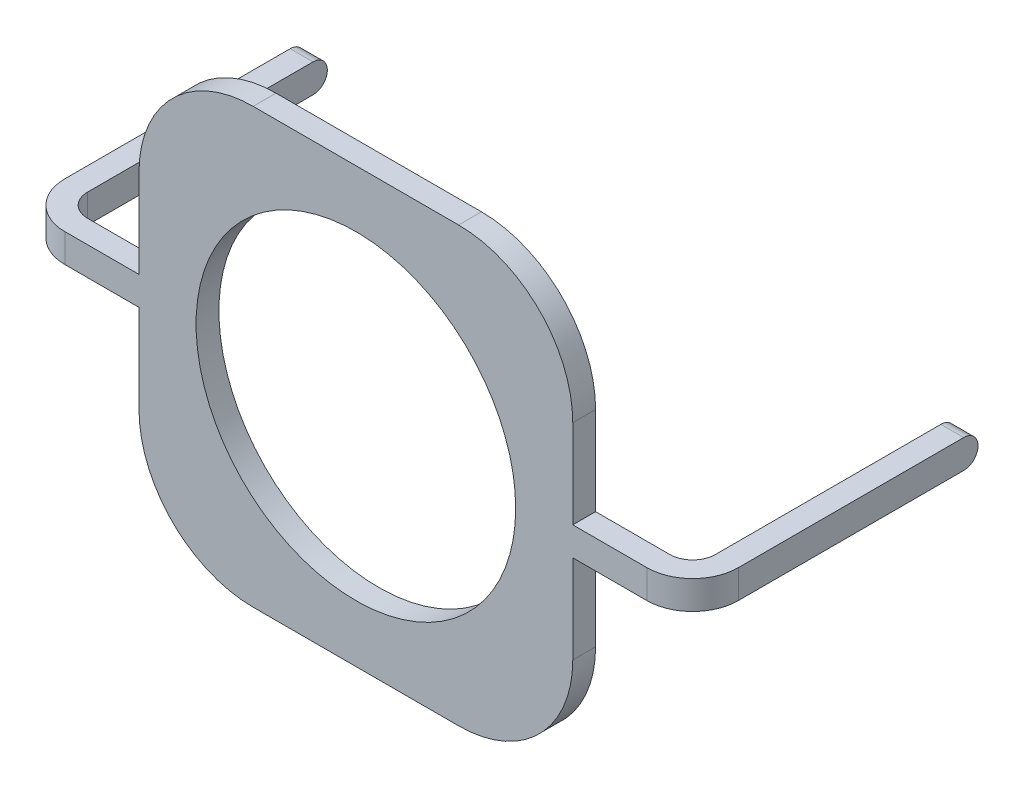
ISO-10303-21;
HEADER;
FILE_DESCRIPTION(('STEP AP214'),'2;1');
FILE_NAME('part.step','',(''),(''),'','','');
FILE_SCHEMA(('AUTOMOTIVE_DESIGN { 1 0 10303 214 1 1 1 1 }'));
ENDSEC;
DATA;
#1=APPLICATION_CONTEXT('core data for automotive mechanical design processes');
#2=APPLICATION_PROTOCOL_DEFINITION('international standard','automotive_design',2000,#1);
#3=PRODUCT_CONTEXT('',#1,'mechanical');
#4=PRODUCT('Part','Part','',(#3));
#5=PRODUCT_RELATED_PRODUCT_CATEGORY('part','',(#4));
#6=PRODUCT_DEFINITION_FORMATION('','',#4);
#7=PRODUCT_DEFINITION_CONTEXT('part definition',#1,'design');
#8=PRODUCT_DEFINITION('design','',#6,#7);
#9=PRODUCT_DEFINITION_SHAPE('','',#8);
#10=(LENGTH_UNIT() NAMED_UNIT(*) SI_UNIT(.MILLI.,.METRE.));
#11=(NAMED_UNIT(*) PLANE_ANGLE_UNIT() SI_UNIT($,.RADIAN.));
#12=(NAMED_UNIT(*) SI_UNIT($,.STERADIAN.) SOLID_ANGLE_UNIT());
#13=UNCERTAINTY_MEASURE_WITH_UNIT(LENGTH_MEASURE(1.E-05),#10,'distance_accuracy_value','');
#14=(GEOMETRIC_REPRESENTATION_CONTEXT(3) GLOBAL_UNCERTAINTY_ASSIGNED_CONTEXT((#13)) GLOBAL_UNIT_ASSIGNED_CONTEXT((#10,
#11,#12)) REPRESENTATION_CONTEXT('',''));
#15=CARTESIAN_POINT('',(0.,0.,0.));
#16=DIRECTION('',(0.,0.,1.));
#17=DIRECTION('',(1.,0.,0.));
#18=AXIS2_PLACEMENT_3D('',#15,#16,#17);
#19=CARTESIAN_POINT('',(-10.,10.,2.));
#20=DIRECTION('',(0.,0.,-1.));
#21=DIRECTION('',(-1.,0.,0.));
#22=AXIS2_PLACEMENT_3D('',#19,#20,#21);
#23=PLANE('',#22);
#24=DIRECTION('',(-1.,0.,0.));
#25=VECTOR('',#24,1.);
#26=CARTESIAN_POINT('',(-38.,20.25,1.99999999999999));
#27=LINE('',#26,#25);
#28=CARTESIAN_POINT('',(-38.,20.25,1.99999999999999));
#29=VERTEX_POINT('',#28);
#30=CARTESIAN_POINT('',(-44.5,20.25,1.99999999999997));
#31=VERTEX_POINT('',#30);
#32=EDGE_CURVE('E263',#29,#31,#27,.T.);
#33=ORIENTED_EDGE('',*,*,#32,.T.);
#34=DIRECTION('',(0.,1.,0.));
#35=VECTOR('',#34,1.);
#36=CARTESIAN_POINT('',(-44.5,10.,1.99999999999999));
#37=LINE('',#36,#35);
#38=CARTESIAN_POINT('',(-44.5,17.75,1.99999999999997));
#39=VERTEX_POINT('',#38);
#40=EDGE_CURVE('E415',#31,#39,#37,.F.);
#41=ORIENTED_EDGE('',*,*,#40,.T.);
#42=DIRECTION('',(1.,0.,0.));
#43=VECTOR('',#42,1.);
#44=CARTESIAN_POINT('',(-38.,17.75,1.99999999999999));
#45=LINE('',#44,#43);
#46=CARTESIAN_POINT('',(-38.,17.75,1.99999999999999));
#47=VERTEX_POINT('',#46);
#48=EDGE_CURVE('E266',#39,#47,#45,.T.);
#49=ORIENTED_EDGE('',*,*,#48,.T.);
#50=DIRECTION('',(0.,-1.,0.));
#51=VECTOR('',#50,1.);
#52=CARTESIAN_POINT('',(-38.,17.75,1.99999999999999));
#53=LINE('',#52,#51);
#54=CARTESIAN_POINT('',(-38.,10.,2.));
#55=VERTEX_POINT('',#54);
#56=EDGE_CURVE('E268',#47,#55,#53,.T.);
#57=ORIENTED_EDGE('',*,*,#56,.T.);
#58=CARTESIAN_POINT('',(-28.,10.,2.));
#59=DIRECTION('',(0.,0.,1.));
#60=DIRECTION('',(1.,0.,0.));
#61=AXIS2_PLACEMENT_3D('',#58,#59,#60);
#62=CIRCLE('',#61,10.);
#63=CARTESIAN_POINT('',(-28.,0.,2.));
#64=VERTEX_POINT('',#63);
#65=EDGE_CURVE('E270',#55,#64,#62,.T.);
#66=ORIENTED_EDGE('',*,*,#65,.T.);
#67=DIRECTION('',(1.,0.,0.));
#68=VECTOR('',#67,1.);
#69=CARTESIAN_POINT('',(-28.,0.,2.));
#70=LINE('',#69,#68);
#71=CARTESIAN_POINT('',(-10.,0.,2.));
#72=VERTEX_POINT('',#71);
#73=EDGE_CURVE('E272',#64,#72,#70,.T.);
#74=ORIENTED_EDGE('',*,*,#73,.T.);
#75=CARTESIAN_POINT('',(-10.,10.,2.));
#76=DIRECTION('',(0.,0.,1.));
#77=DIRECTION('',(-1.,0.,0.));
#78=AXIS2_PLACEMENT_3D('',#75,#76,#77);
#79=CIRCLE('',#78,10.);
#80=CARTESIAN_POINT('',(0.,10.0000000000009,2.));
#81=VERTEX_POINT('',#80);
#82=EDGE_CURVE('E245',#72,#81,#79,.T.);
#83=ORIENTED_EDGE('',*,*,#82,.T.);
#84=DIRECTION('',(0.,1.,0.));
#85=VECTOR('',#84,1.);
#86=CARTESIAN_POINT('',(0.,17.7500000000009,1.99999999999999));
#87=LINE('',#86,#85);
#88=CARTESIAN_POINT('',(0.,17.7500000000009,1.99999999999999));
#89=VERTEX_POINT('',#88);
#90=EDGE_CURVE('E209',#81,#89,#87,.T.);
#91=ORIENTED_EDGE('',*,*,#90,.T.);
#92=DIRECTION('',(1.,0.,0.));
#93=VECTOR('',#92,1.);
#94=CARTESIAN_POINT('',(0.,17.7500000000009,1.99999999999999));
#95=LINE('',#94,#93);
#96=CARTESIAN_POINT('',(6.50000000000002,17.7500000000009,2.));
#97=VERTEX_POINT('',#96);
#98=EDGE_CURVE('E248',#89,#97,#95,.T.);
#99=ORIENTED_EDGE('',*,*,#98,.T.);
#100=DIRECTION('',(0.,-1.,0.));
#101=VECTOR('',#100,1.);
#102=CARTESIAN_POINT('',(6.50000000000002,10.0000000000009,2.));
#103=LINE('',#102,#101);
#104=CARTESIAN_POINT('',(6.5,20.2500000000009,1.99999999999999));
#105=VERTEX_POINT('',#104);
#106=EDGE_CURVE('E420',#97,#105,#103,.F.);
#107=ORIENTED_EDGE('',*,*,#106,.T.);
#108=DIRECTION('',(-1.,0.,0.));
#109=VECTOR('',#108,1.);
#110=CARTESIAN_POINT('',(0.,20.2500000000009,1.99999999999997));
#111=LINE('',#110,#109);
#112=CARTESIAN_POINT('',(0.,20.2500000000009,1.99999999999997));
#113=VERTEX_POINT('',#112);
#114=EDGE_CURVE('E251',#105,#113,#111,.T.);
#115=ORIENTED_EDGE('',*,*,#114,.T.);
#116=DIRECTION('',(0.,1.,0.));
#117=VECTOR('',#116,1.);
#118=CARTESIAN_POINT('',(0.,28.0000000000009,2.));
#119=LINE('',#118,#117);
#120=CARTESIAN_POINT('',(0.,28.0000000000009,2.));
#121=VERTEX_POINT('',#120);
#122=EDGE_CURVE('E253',#113,#121,#119,.T.);
#123=ORIENTED_EDGE('',*,*,#122,.T.);
#124=CARTESIAN_POINT('',(-10.,28.0000000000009,2.));
#125=DIRECTION('',(0.,0.,1.));
#126=DIRECTION('',(1.,0.,0.));
#127=AXIS2_PLACEMENT_3D('',#124,#125,#126);
#128=CIRCLE('',#127,10.);
#129=CARTESIAN_POINT('',(-10.,38.000000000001,2.));
#130=VERTEX_POINT('',#129);
#131=EDGE_CURVE('E255',#121,#130,#128,.T.);
#132=ORIENTED_EDGE('',*,*,#131,.T.);
#133=DIRECTION('',(-1.,0.,0.));
#134=VECTOR('',#133,1.);
#135=CARTESIAN_POINT('',(-28.,38.000000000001,2.));
#136=LINE('',#135,#134);
#137=CARTESIAN_POINT('',(-28.,38.000000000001,2.));
#138=VERTEX_POINT('',#137);
#139=EDGE_CURVE('E257',#130,#138,#136,.T.);
#140=ORIENTED_EDGE('',*,*,#139,.T.);
#141=CARTESIAN_POINT('',(-28.,28.0000000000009,2.));
#142=DIRECTION('',(0.,0.,1.));
#143=DIRECTION('',(1.,0.,0.));
#144=AXIS2_PLACEMENT_3D('',#141,#142,#143);
#145=CIRCLE('',#144,10.);
#146=CARTESIAN_POINT('',(-38.,28.,2.));
#147=VERTEX_POINT('',#146);
#148=EDGE_CURVE('E259',#138,#147,#145,.T.);
#149=ORIENTED_EDGE('',*,*,#148,.T.);
#150=DIRECTION('',(0.,-1.,0.));
#151=VECTOR('',#150,1.);
#152=CARTESIAN_POINT('',(-38.,28.,2.));
#153=LINE('',#152,#151);
#154=EDGE_CURVE('E261',#147,#29,#153,.T.);
#155=ORIENTED_EDGE('',*,*,#154,.T.);
#156=EDGE_LOOP('',(#33,#41,#49,#57,#66,#74,#83,#91,#99,#107,#115,#123,#132,#140,#149,#155));
#157=FACE_BOUND('',#156,.T.);
#158=CARTESIAN_POINT('',(-19.,19.,1.99999999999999));
#159=DIRECTION('',(0.,0.,1.));
#160=DIRECTION('',(1.,0.,0.));
#161=AXIS2_PLACEMENT_3D('',#158,#159,#160);
#162=CIRCLE('',#161,14.);
#163=CARTESIAN_POINT('',(-5.,19.,1.99999999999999));
#164=VERTEX_POINT('',#163);
#165=EDGE_CURVE('E219',#164,#164,#162,.T.);
#166=ORIENTED_EDGE('',*,*,#165,.F.);
#167=EDGE_LOOP('',(#166));
#168=FACE_BOUND('',#167,.T.);
#169=ADVANCED_FACE('F22',(#157,#168),#23,.F.);
#170=CARTESIAN_POINT('',(-10.,10.0000000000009,0.));
#171=DIRECTION('',(0.,0.,-1.));
#172=DIRECTION('',(-1.,0.,0.));
#173=AXIS2_PLACEMENT_3D('',#170,#171,#172);
#174=PLANE('',#173);
#175=DIRECTION('',(1.,0.,0.));
#176=VECTOR('',#175,1.);
#177=CARTESIAN_POINT('',(-38.,17.75,0.));
#178=LINE('',#177,#176);
#179=CARTESIAN_POINT('',(-44.5,17.75,0.));
#180=VERTEX_POINT('',#179);
#181=CARTESIAN_POINT('',(-38.,17.75,0.));
#182=VERTEX_POINT('',#181);
#183=EDGE_CURVE('E241',#180,#182,#178,.T.);
#184=ORIENTED_EDGE('',*,*,#183,.F.);
#185=DIRECTION('',(0.,-1.,0.));
#186=VECTOR('',#185,1.);
#187=CARTESIAN_POINT('',(-44.4999999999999,20.25,0.));
#188=LINE('',#187,#186);
#189=CARTESIAN_POINT('',(-44.4999999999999,20.25,0.));
#190=VERTEX_POINT('',#189);
#191=EDGE_CURVE('E313',#180,#190,#188,.F.);
#192=ORIENTED_EDGE('',*,*,#191,.T.);
#193=DIRECTION('',(-1.,0.,0.));
#194=VECTOR('',#193,1.);
#195=CARTESIAN_POINT('',(-37.9999999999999,20.25,0.));
#196=LINE('',#195,#194);
#197=CARTESIAN_POINT('',(-37.9999999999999,20.25,0.));
#198=VERTEX_POINT('',#197);
#199=EDGE_CURVE('E237',#198,#190,#196,.T.);
#200=ORIENTED_EDGE('',*,*,#199,.F.);
#201=DIRECTION('',(0.,-1.,0.));
#202=VECTOR('',#201,1.);
#203=CARTESIAN_POINT('',(-38.,28.,0.));
#204=LINE('',#203,#202);
#205=CARTESIAN_POINT('',(-38.,28.,0.));
#206=VERTEX_POINT('',#205);
#207=EDGE_CURVE('E235',#206,#198,#204,.T.);
#208=ORIENTED_EDGE('',*,*,#207,.F.);
#209=CARTESIAN_POINT('',(-28.0000000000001,28.0000000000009,0.));
#210=DIRECTION('',(0.,0.,1.));
#211=DIRECTION('',(1.,0.,0.));
#212=AXIS2_PLACEMENT_3D('',#209,#210,#211);
#213=CIRCLE('',#212,10.);
#214=CARTESIAN_POINT('',(-28.,38.000000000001,0.));
#215=VERTEX_POINT('',#214);
#216=EDGE_CURVE('E233',#215,#206,#213,.T.);
#217=ORIENTED_EDGE('',*,*,#216,.F.);
#218=DIRECTION('',(-1.,0.,0.));
#219=VECTOR('',#218,1.);
#220=CARTESIAN_POINT('',(-28.,38.000000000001,0.));
#221=LINE('',#220,#219);
#222=CARTESIAN_POINT('',(-10.,38.000000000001,0.));
#223=VERTEX_POINT('',#222);
#224=EDGE_CURVE('E231',#223,#215,#221,.T.);
#225=ORIENTED_EDGE('',*,*,#224,.F.);
#226=CARTESIAN_POINT('',(-10.,28.0000000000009,0.));
#227=DIRECTION('',(0.,0.,1.));
#228=DIRECTION('',(1.,0.,0.));
#229=AXIS2_PLACEMENT_3D('',#226,#227,#228);
#230=CIRCLE('',#229,10.);
#231=CARTESIAN_POINT('',(0.,28.0000000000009,0.));
#232=VERTEX_POINT('',#231);
#233=EDGE_CURVE('E228',#232,#223,#230,.T.);
#234=ORIENTED_EDGE('',*,*,#233,.F.);
#235=DIRECTION('',(0.,1.,0.));
#236=VECTOR('',#235,1.);
#237=CARTESIAN_POINT('',(0.,28.0000000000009,0.));
#238=LINE('',#237,#236);
#239=CARTESIAN_POINT('',(0.,20.2500000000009,0.));
#240=VERTEX_POINT('',#239);
#241=EDGE_CURVE('E226',#240,#232,#238,.T.);
#242=ORIENTED_EDGE('',*,*,#241,.F.);
#243=DIRECTION('',(-1.,0.,0.));
#244=VECTOR('',#243,1.);
#245=CARTESIAN_POINT('',(0.,20.2500000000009,0.));
#246=LINE('',#245,#244);
#247=CARTESIAN_POINT('',(6.5,20.2500000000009,0.));
#248=VERTEX_POINT('',#247);
#249=EDGE_CURVE('E229',#248,#240,#246,.T.);
#250=ORIENTED_EDGE('',*,*,#249,.F.);
#251=DIRECTION('',(0.,1.,0.));
#252=VECTOR('',#251,1.);
#253=CARTESIAN_POINT('',(6.50000000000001,17.7500000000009,0.));
#254=LINE('',#253,#252);
#255=CARTESIAN_POINT('',(6.50000000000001,17.7500000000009,0.));
#256=VERTEX_POINT('',#255);
#257=EDGE_CURVE('E311',#248,#256,#254,.F.);
#258=ORIENTED_EDGE('',*,*,#257,.T.);
#259=DIRECTION('',(1.,0.,0.));
#260=VECTOR('',#259,1.);
#261=CARTESIAN_POINT('',(0.,17.7500000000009,0.));
#262=LINE('',#261,#260);
#263=CARTESIAN_POINT('',(0.,17.7500000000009,0.));
#264=VERTEX_POINT('',#263);
#265=EDGE_CURVE('E201',#264,#256,#262,.T.);
#266=ORIENTED_EDGE('',*,*,#265,.F.);
#267=DIRECTION('',(0.,1.,0.));
#268=VECTOR('',#267,1.);
#269=CARTESIAN_POINT('',(0.,17.7500000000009,0.));
#270=LINE('',#269,#268);
#271=CARTESIAN_POINT('',(0.,10.0000000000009,0.));
#272=VERTEX_POINT('',#271);
#273=EDGE_CURVE('E192',#272,#264,#270,.T.);
#274=ORIENTED_EDGE('',*,*,#273,.F.);
#275=CARTESIAN_POINT('',(-10.,10.0000000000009,0.));
#276=DIRECTION('',(0.,0.,1.));
#277=DIRECTION('',(-1.,0.,0.));
#278=AXIS2_PLACEMENT_3D('',#275,#276,#277);
#279=CIRCLE('',#278,10.);
#280=CARTESIAN_POINT('',(-10.,0.,0.));
#281=VERTEX_POINT('',#280);
#282=EDGE_CURVE('E199',#281,#272,#279,.T.);
#283=ORIENTED_EDGE('',*,*,#282,.F.);
#284=DIRECTION('',(1.,0.,0.));
#285=VECTOR('',#284,1.);
#286=CARTESIAN_POINT('',(-28.,0.,0.));
#287=LINE('',#286,#285);
#288=CARTESIAN_POINT('',(-28.,0.,0.));
#289=VERTEX_POINT('',#288);
#290=EDGE_CURVE('E243',#289,#281,#287,.T.);
#291=ORIENTED_EDGE('',*,*,#290,.F.);
#292=CARTESIAN_POINT('',(-28.,10.,0.));
#293=DIRECTION('',(0.,0.,1.));
#294=DIRECTION('',(1.,0.,0.));
#295=AXIS2_PLACEMENT_3D('',#292,#293,#294);
#296=CIRCLE('',#295,10.);
#297=CARTESIAN_POINT('',(-38.,10.,0.));
#298=VERTEX_POINT('',#297);
#299=EDGE_CURVE('E240',#298,#289,#296,.T.);
#300=ORIENTED_EDGE('',*,*,#299,.F.);
#301=DIRECTION('',(0.,-1.,0.));
#302=VECTOR('',#301,1.);
#303=CARTESIAN_POINT('',(-38.,17.75,0.));
#304=LINE('',#303,#302);
#305=EDGE_CURVE('E238',#182,#298,#304,.T.);
#306=ORIENTED_EDGE('',*,*,#305,.F.);
#307=EDGE_LOOP('',(#184,#192,#200,#208,#217,#225,#234,#242,#250,#258,#266,#274,#283,#291,#300,#306));
#308=FACE_BOUND('',#307,.T.);
#309=CARTESIAN_POINT('',(-19.,19.0000000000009,0.));
#310=DIRECTION('',(0.,0.,1.));
#311=DIRECTION('',(1.,0.,0.));
#312=AXIS2_PLACEMENT_3D('',#309,#310,#311);
#313=CIRCLE('',#312,14.);
#314=CARTESIAN_POINT('',(-5.,19.0000000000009,0.));
#315=VERTEX_POINT('',#314);
#316=EDGE_CURVE('E222',#315,#315,#313,.T.);
#317=ORIENTED_EDGE('',*,*,#316,.T.);
#318=EDGE_LOOP('',(#317));
#319=FACE_BOUND('',#318,.T.);
#320=ADVANCED_FACE('F195',(#308,#319),#174,.T.);
#321=CARTESIAN_POINT('',(-10.,10.,2.));
#322=DIRECTION('',(0.,0.,-1.));
#323=DIRECTION('',(-1.,0.,0.));
#324=AXIS2_PLACEMENT_3D('',#321,#322,#323);
#325=CYLINDRICAL_SURFACE('',#324,10.);
#326=ORIENTED_EDGE('',*,*,#282,.T.);
#327=DIRECTION('',(0.,0.,-1.));
#328=VECTOR('',#327,1.);
#329=CARTESIAN_POINT('',(0.,10.0000000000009,2.));
#330=LINE('',#329,#328);
#331=EDGE_CURVE('E207',#81,#272,#330,.T.);
#332=ORIENTED_EDGE('',*,*,#331,.F.);
#333=ORIENTED_EDGE('',*,*,#82,.F.);
#334=DIRECTION('',(0.,0.,-1.));
#335=VECTOR('',#334,1.);
#336=CARTESIAN_POINT('',(-10.,0.,2.));
#337=LINE('',#336,#335);
#338=EDGE_CURVE('E218',#72,#281,#337,.T.);
#339=ORIENTED_EDGE('',*,*,#338,.T.);
#340=EDGE_LOOP('',(#326,#332,#333,#339));
#341=FACE_BOUND('',#340,.T.);
#342=ADVANCED_FACE('F24',(#341),#325,.T.);
#343=CARTESIAN_POINT('',(0.,17.7500000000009,1.99999999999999));
#344=DIRECTION('',(-1.,0.,0.));
#345=DIRECTION('',(0.,-1.,0.));
#346=AXIS2_PLACEMENT_3D('',#343,#344,#345);
#347=PLANE('',#346);
#348=ORIENTED_EDGE('',*,*,#273,.T.);
#349=DIRECTION('',(0.,0.,-1.));
#350=VECTOR('',#349,1.);
#351=CARTESIAN_POINT('',(0.,17.7500000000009,1.99999999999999));
#352=LINE('',#351,#350);
#353=EDGE_CURVE('E214',#89,#264,#352,.T.);
#354=ORIENTED_EDGE('',*,*,#353,.F.);
#355=ORIENTED_EDGE('',*,*,#90,.F.);
#356=ORIENTED_EDGE('',*,*,#331,.T.);
#357=EDGE_LOOP('',(#348,#354,#355,#356));
#358=FACE_BOUND('',#357,.T.);
#359=ADVANCED_FACE('F208',(#358),#347,.F.);
#360=CARTESIAN_POINT('',(0.,17.7500000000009,1.99999999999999));
#361=DIRECTION('',(0.,1.,0.));
#362=DIRECTION('',(0.,0.,1.));
#363=AXIS2_PLACEMENT_3D('',#360,#361,#362);
#364=PLANE('',#363);
#365=DIRECTION('',(0.,0.,-1.));
#366=VECTOR('',#365,1.);
#367=CARTESIAN_POINT('',(8.50000000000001,17.7500000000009,1.99999999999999));
#368=LINE('',#367,#366);
#369=CARTESIAN_POINT('',(8.50000000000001,17.7500000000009,-2.00000000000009));
#370=VERTEX_POINT('',#369);
#371=CARTESIAN_POINT('',(8.50000000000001,17.7500000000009,-21.7500000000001));
#372=VERTEX_POINT('',#371);
#373=EDGE_CURVE('E317',#370,#372,#368,.T.);
#374=ORIENTED_EDGE('',*,*,#373,.T.);
#375=DIRECTION('',(-1.,0.,0.));
#376=VECTOR('',#375,1.);
#377=CARTESIAN_POINT('',(0.,17.7500000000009,-21.7500000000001));
#378=LINE('',#377,#376);
#379=CARTESIAN_POINT('',(10.5,17.7500000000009,-21.7500000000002));
#380=VERTEX_POINT('',#379);
#381=EDGE_CURVE('E341',#372,#380,#378,.F.);
#382=ORIENTED_EDGE('',*,*,#381,.T.);
#383=DIRECTION('',(0.,0.,-1.));
#384=VECTOR('',#383,1.);
#385=CARTESIAN_POINT('',(10.5,17.7500000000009,1.99999999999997));
#386=LINE('',#385,#384);
#387=CARTESIAN_POINT('',(10.5,17.7500000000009,-2.00000000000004));
#388=VERTEX_POINT('',#387);
#389=EDGE_CURVE('E330',#388,#380,#386,.T.);
#390=ORIENTED_EDGE('',*,*,#389,.F.);
#391=CARTESIAN_POINT('',(6.50000000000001,17.7500000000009,-2.));
#392=DIRECTION('',(0.,1.,0.));
#393=DIRECTION('',(0.,0.,1.));
#394=AXIS2_PLACEMENT_3D('',#391,#392,#393);
#395=CIRCLE('',#394,4.);
#396=EDGE_CURVE('E430',#388,#97,#395,.F.);
#397=ORIENTED_EDGE('',*,*,#396,.T.);
#398=ORIENTED_EDGE('',*,*,#98,.F.);
#399=ORIENTED_EDGE('',*,*,#353,.T.);
#400=ORIENTED_EDGE('',*,*,#265,.T.);
#401=CARTESIAN_POINT('',(6.50000000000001,17.7500000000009,-2.));
#402=DIRECTION('',(0.,1.,0.));
#403=DIRECTION('',(0.,0.,1.));
#404=AXIS2_PLACEMENT_3D('',#401,#402,#403);
#405=CIRCLE('',#404,2.);
#406=EDGE_CURVE('E373',#256,#370,#405,.T.);
#407=ORIENTED_EDGE('',*,*,#406,.T.);
#408=EDGE_LOOP('',(#374,#382,#390,#397,#398,#399,#400,#407));
#409=FACE_BOUND('',#408,.T.);
#410=ADVANCED_FACE('F370',(#409),#364,.F.);
#411=CARTESIAN_POINT('',(0.,20.2500000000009,1.99999999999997));
#412=DIRECTION('',(0.,-1.,0.));
#413=DIRECTION('',(0.,0.,-1.));
#414=AXIS2_PLACEMENT_3D('',#411,#412,#413);
#415=PLANE('',#414);
#416=DIRECTION('',(0.,0.,1.));
#417=VECTOR('',#416,1.);
#418=CARTESIAN_POINT('',(10.5,20.2500000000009,1.99999999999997));
#419=LINE('',#418,#417);
#420=CARTESIAN_POINT('',(10.5,20.2500000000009,-21.7500000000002));
#421=VERTEX_POINT('',#420);
#422=CARTESIAN_POINT('',(10.5,20.2500000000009,-2.00000000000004));
#423=VERTEX_POINT('',#422);
#424=EDGE_CURVE('E351',#421,#423,#419,.T.);
#425=ORIENTED_EDGE('',*,*,#424,.F.);
#426=DIRECTION('',(-1.,0.,0.));
#427=VECTOR('',#426,1.);
#428=CARTESIAN_POINT('',(0.,20.2500000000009,-21.7500000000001));
#429=LINE('',#428,#427);
#430=CARTESIAN_POINT('',(8.5,20.2500000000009,-21.7500000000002));
#431=VERTEX_POINT('',#430);
#432=EDGE_CURVE('E30',#421,#431,#429,.T.);
#433=ORIENTED_EDGE('',*,*,#432,.T.);
#434=DIRECTION('',(0.,0.,1.));
#435=VECTOR('',#434,1.);
#436=CARTESIAN_POINT('',(8.5,20.2500000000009,2.));
#437=LINE('',#436,#435);
#438=CARTESIAN_POINT('',(8.5,20.2500000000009,-2.00000000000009));
#439=VERTEX_POINT('',#438);
#440=EDGE_CURVE('E321',#431,#439,#437,.T.);
#441=ORIENTED_EDGE('',*,*,#440,.T.);
#442=CARTESIAN_POINT('',(6.50000000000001,20.2500000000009,-2.));
#443=DIRECTION('',(0.,-1.,0.));
#444=DIRECTION('',(0.,0.,-1.));
#445=AXIS2_PLACEMENT_3D('',#442,#443,#444);
#446=CIRCLE('',#445,2.);
#447=EDGE_CURVE('E377',#439,#248,#446,.T.);
#448=ORIENTED_EDGE('',*,*,#447,.T.);
#449=ORIENTED_EDGE('',*,*,#249,.T.);
#450=DIRECTION('',(0.,0.,-1.));
#451=VECTOR('',#450,1.);
#452=CARTESIAN_POINT('',(0.,20.2500000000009,1.99999999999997));
#453=LINE('',#452,#451);
#454=EDGE_CURVE('E299',#113,#240,#453,.T.);
#455=ORIENTED_EDGE('',*,*,#454,.F.);
#456=ORIENTED_EDGE('',*,*,#114,.F.);
#457=CARTESIAN_POINT('',(6.50000000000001,20.2500000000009,-2.));
#458=DIRECTION('',(0.,-1.,0.));
#459=DIRECTION('',(0.,0.,-1.));
#460=AXIS2_PLACEMENT_3D('',#457,#458,#459);
#461=CIRCLE('',#460,4.);
#462=EDGE_CURVE('E432',#105,#423,#461,.F.);
#463=ORIENTED_EDGE('',*,*,#462,.T.);
#464=EDGE_LOOP('',(#425,#433,#441,#448,#449,#455,#456,#463));
#465=FACE_BOUND('',#464,.T.);
#466=ADVANCED_FACE('F348',(#465),#415,.F.);
#467=CARTESIAN_POINT('',(0.,28.0000000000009,2.));
#468=DIRECTION('',(-1.,0.,0.));
#469=DIRECTION('',(0.,-1.,0.));
#470=AXIS2_PLACEMENT_3D('',#467,#468,#469);
#471=PLANE('',#470);
#472=ORIENTED_EDGE('',*,*,#241,.T.);
#473=DIRECTION('',(0.,0.,-1.));
#474=VECTOR('',#473,1.);
#475=CARTESIAN_POINT('',(0.,28.0000000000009,2.));
#476=LINE('',#475,#474);
#477=EDGE_CURVE('E296',#121,#232,#476,.T.);
#478=ORIENTED_EDGE('',*,*,#477,.F.);
#479=ORIENTED_EDGE('',*,*,#122,.F.);
#480=ORIENTED_EDGE('',*,*,#454,.T.);
#481=EDGE_LOOP('',(#472,#478,#479,#480));
#482=FACE_BOUND('',#481,.T.);
#483=ADVANCED_FACE('F529',(#482),#471,.F.);
#484=CARTESIAN_POINT('',(-10.,28.0000000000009,2.));
#485=DIRECTION('',(0.,0.,-1.));
#486=DIRECTION('',(-1.,0.,0.));
#487=AXIS2_PLACEMENT_3D('',#484,#485,#486);
#488=CYLINDRICAL_SURFACE('',#487,10.);
#489=ORIENTED_EDGE('',*,*,#233,.T.);
#490=DIRECTION('',(0.,0.,-1.));
#491=VECTOR('',#490,1.);
#492=CARTESIAN_POINT('',(-10.,38.000000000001,2.));
#493=LINE('',#492,#491);
#494=EDGE_CURVE('E293',#130,#223,#493,.T.);
#495=ORIENTED_EDGE('',*,*,#494,.F.);
#496=ORIENTED_EDGE('',*,*,#131,.F.);
#497=ORIENTED_EDGE('',*,*,#477,.T.);
#498=EDGE_LOOP('',(#489,#495,#496,#497));
#499=FACE_BOUND('',#498,.T.);
#500=ADVANCED_FACE('F525',(#499),#488,.T.);
#501=CARTESIAN_POINT('',(-28.,38.000000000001,2.));
#502=DIRECTION('',(0.,-1.,0.));
#503=DIRECTION('',(0.,0.,-1.));
#504=AXIS2_PLACEMENT_3D('',#501,#502,#503);
#505=PLANE('',#504);
#506=ORIENTED_EDGE('',*,*,#224,.T.);
#507=DIRECTION('',(0.,0.,-1.));
#508=VECTOR('',#507,1.);
#509=CARTESIAN_POINT('',(-28.,38.000000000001,2.));
#510=LINE('',#509,#508);
#511=EDGE_CURVE('E290',#138,#215,#510,.T.);
#512=ORIENTED_EDGE('',*,*,#511,.F.);
#513=ORIENTED_EDGE('',*,*,#139,.F.);
#514=ORIENTED_EDGE('',*,*,#494,.T.);
#515=EDGE_LOOP('',(#506,#512,#513,#514));
#516=FACE_BOUND('',#515,.T.);
#517=ADVANCED_FACE('F521',(#516),#505,.F.);
#518=CARTESIAN_POINT('',(-28.,28.0000000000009,2.));
#519=DIRECTION('',(0.,0.,-1.));
#520=DIRECTION('',(-1.,0.,0.));
#521=AXIS2_PLACEMENT_3D('',#518,#519,#520);
#522=CYLINDRICAL_SURFACE('',#521,10.);
#523=ORIENTED_EDGE('',*,*,#216,.T.);
#524=DIRECTION('',(0.,0.,-1.));
#525=VECTOR('',#524,1.);
#526=CARTESIAN_POINT('',(-38.,28.,2.));
#527=LINE('',#526,#525);
#528=EDGE_CURVE('E287',#147,#206,#527,.T.);
#529=ORIENTED_EDGE('',*,*,#528,.F.);
#530=ORIENTED_EDGE('',*,*,#148,.F.);
#531=ORIENTED_EDGE('',*,*,#511,.T.);
#532=EDGE_LOOP('',(#523,#529,#530,#531));
#533=FACE_BOUND('',#532,.T.);
#534=ADVANCED_FACE('F517',(#533),#522,.T.);
#535=CARTESIAN_POINT('',(-38.,28.,2.));
#536=DIRECTION('',(1.,0.,0.));
#537=DIRECTION('',(0.,1.,0.));
#538=AXIS2_PLACEMENT_3D('',#535,#536,#537);
#539=PLANE('',#538);
#540=ORIENTED_EDGE('',*,*,#207,.T.);
#541=DIRECTION('',(0.,0.,-1.));
#542=VECTOR('',#541,1.);
#543=CARTESIAN_POINT('',(-38.,20.25,1.99999999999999));
#544=LINE('',#543,#542);
#545=EDGE_CURVE('E284',#29,#198,#544,.T.);
#546=ORIENTED_EDGE('',*,*,#545,.F.);
#547=ORIENTED_EDGE('',*,*,#154,.F.);
#548=ORIENTED_EDGE('',*,*,#528,.T.);
#549=EDGE_LOOP('',(#540,#546,#547,#548));
#550=FACE_BOUND('',#549,.T.);
#551=ADVANCED_FACE('F514',(#550),#539,.F.);
#552=CARTESIAN_POINT('',(-38.,20.25,1.99999999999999));
#553=DIRECTION('',(0.,-1.,0.));
#554=DIRECTION('',(0.,0.,-1.));
#555=AXIS2_PLACEMENT_3D('',#552,#553,#554);
#556=PLANE('',#555);
#557=DIRECTION('',(0.,0.,-1.));
#558=VECTOR('',#557,1.);
#559=CARTESIAN_POINT('',(-46.5,20.2500000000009,-23.0000000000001));
#560=LINE('',#559,#558);
#561=CARTESIAN_POINT('',(-46.5,20.25,-2.00000000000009));
#562=VERTEX_POINT('',#561);
#563=CARTESIAN_POINT('',(-46.5,20.2500000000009,-21.7500000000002));
#564=VERTEX_POINT('',#563);
#565=EDGE_CURVE('E389',#562,#564,#560,.T.);
#566=ORIENTED_EDGE('',*,*,#565,.T.);
#567=DIRECTION('',(1.,0.,0.));
#568=VECTOR('',#567,1.);
#569=CARTESIAN_POINT('',(-38.,20.2500000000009,-21.7500000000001));
#570=LINE('',#569,#568);
#571=CARTESIAN_POINT('',(-48.5,20.2500000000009,-21.7500000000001));
#572=VERTEX_POINT('',#571);
#573=EDGE_CURVE('E11',#564,#572,#570,.F.);
#574=ORIENTED_EDGE('',*,*,#573,.T.);
#575=DIRECTION('',(0.,0.,-1.));
#576=VECTOR('',#575,1.);
#577=CARTESIAN_POINT('',(-48.5,20.25,1.99999999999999));
#578=LINE('',#577,#576);
#579=CARTESIAN_POINT('',(-48.5,20.25,-2.));
#580=VERTEX_POINT('',#579);
#581=EDGE_CURVE('E388',#580,#572,#578,.T.);
#582=ORIENTED_EDGE('',*,*,#581,.F.);
#583=CARTESIAN_POINT('',(-44.5,20.25,-2.00000000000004));
#584=DIRECTION('',(0.,-1.,0.));
#585=DIRECTION('',(0.,0.,-1.));
#586=AXIS2_PLACEMENT_3D('',#583,#584,#585);
#587=CIRCLE('',#586,4.);
#588=EDGE_CURVE('E418',#580,#31,#587,.F.);
#589=ORIENTED_EDGE('',*,*,#588,.T.);
#590=ORIENTED_EDGE('',*,*,#32,.F.);
#591=ORIENTED_EDGE('',*,*,#545,.T.);
#592=ORIENTED_EDGE('',*,*,#199,.T.);
#593=CARTESIAN_POINT('',(-44.5,20.25,-2.00000000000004));
#594=DIRECTION('',(0.,-1.,0.));
#595=DIRECTION('',(0.,0.,-1.));
#596=AXIS2_PLACEMENT_3D('',#593,#594,#595);
#597=CIRCLE('',#596,2.);
#598=EDGE_CURVE('E382',#190,#562,#597,.T.);
#599=ORIENTED_EDGE('',*,*,#598,.T.);
#600=EDGE_LOOP('',(#566,#574,#582,#589,#590,#591,#592,#599));
#601=FACE_BOUND('',#600,.T.);
#602=ADVANCED_FACE('F449',(#601),#556,.F.);
#603=CARTESIAN_POINT('',(-38.,17.75,1.99999999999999));
#604=DIRECTION('',(0.,1.,0.));
#605=DIRECTION('',(0.,0.,1.));
#606=AXIS2_PLACEMENT_3D('',#603,#604,#605);
#607=PLANE('',#606);
#608=DIRECTION('',(0.,0.,1.));
#609=VECTOR('',#608,1.);
#610=CARTESIAN_POINT('',(-48.5,17.75,0.));
#611=LINE('',#610,#609);
#612=CARTESIAN_POINT('',(-48.5,17.75,-21.7500000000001));
#613=VERTEX_POINT('',#612);
#614=CARTESIAN_POINT('',(-48.5,17.75,-2.));
#615=VERTEX_POINT('',#614);
#616=EDGE_CURVE('E322',#613,#615,#611,.T.);
#617=ORIENTED_EDGE('',*,*,#616,.F.);
#618=DIRECTION('',(1.,0.,0.));
#619=VECTOR('',#618,1.);
#620=CARTESIAN_POINT('',(-38.,17.7500000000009,-21.7500000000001));
#621=LINE('',#620,#619);
#622=CARTESIAN_POINT('',(-46.5,17.75,-21.7500000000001));
#623=VERTEX_POINT('',#622);
#624=EDGE_CURVE('E376',#613,#623,#621,.T.);
#625=ORIENTED_EDGE('',*,*,#624,.T.);
#626=DIRECTION('',(0.,0.,1.));
#627=VECTOR('',#626,1.);
#628=CARTESIAN_POINT('',(-46.5,17.75,1.99999999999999));
#629=LINE('',#628,#627);
#630=CARTESIAN_POINT('',(-46.5,17.75,-2.00000000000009));
#631=VERTEX_POINT('',#630);
#632=EDGE_CURVE('E386',#623,#631,#629,.T.);
#633=ORIENTED_EDGE('',*,*,#632,.T.);
#634=CARTESIAN_POINT('',(-44.5,17.75,-2.00000000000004));
#635=DIRECTION('',(0.,1.,0.));
#636=DIRECTION('',(0.,0.,1.));
#637=AXIS2_PLACEMENT_3D('',#634,#635,#636);
#638=CIRCLE('',#637,2.);
#639=EDGE_CURVE('E446',#631,#180,#638,.T.);
#640=ORIENTED_EDGE('',*,*,#639,.T.);
#641=ORIENTED_EDGE('',*,*,#183,.T.);
#642=DIRECTION('',(0.,0.,-1.));
#643=VECTOR('',#642,1.);
#644=CARTESIAN_POINT('',(-38.,17.75,1.99999999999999));
#645=LINE('',#644,#643);
#646=EDGE_CURVE('E281',#47,#182,#645,.T.);
#647=ORIENTED_EDGE('',*,*,#646,.F.);
#648=ORIENTED_EDGE('',*,*,#48,.F.);
#649=CARTESIAN_POINT('',(-44.5,17.75,-2.00000000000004));
#650=DIRECTION('',(0.,1.,0.));
#651=DIRECTION('',(0.,0.,1.));
#652=AXIS2_PLACEMENT_3D('',#649,#650,#651);
#653=CIRCLE('',#652,4.);
#654=EDGE_CURVE('E409',#39,#615,#653,.F.);
#655=ORIENTED_EDGE('',*,*,#654,.T.);
#656=EDGE_LOOP('',(#617,#625,#633,#640,#641,#647,#648,#655));
#657=FACE_BOUND('',#656,.T.);
#658=ADVANCED_FACE('F410',(#657),#607,.F.);
#659=CARTESIAN_POINT('',(-38.,17.75,1.99999999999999));
#660=DIRECTION('',(1.,0.,0.));
#661=DIRECTION('',(0.,1.,0.));
#662=AXIS2_PLACEMENT_3D('',#659,#660,#661);
#663=PLANE('',#662);
#664=ORIENTED_EDGE('',*,*,#305,.T.);
#665=DIRECTION('',(0.,0.,-1.));
#666=VECTOR('',#665,1.);
#667=CARTESIAN_POINT('',(-38.,10.,2.));
#668=LINE('',#667,#666);
#669=EDGE_CURVE('E278',#55,#298,#668,.T.);
#670=ORIENTED_EDGE('',*,*,#669,.F.);
#671=ORIENTED_EDGE('',*,*,#56,.F.);
#672=ORIENTED_EDGE('',*,*,#646,.T.);
#673=EDGE_LOOP('',(#664,#670,#671,#672));
#674=FACE_BOUND('',#673,.T.);
#675=ADVANCED_FACE('F460',(#674),#663,.F.);
#676=CARTESIAN_POINT('',(-28.,10.,2.));
#677=DIRECTION('',(0.,0.,-1.));
#678=DIRECTION('',(-1.,0.,0.));
#679=AXIS2_PLACEMENT_3D('',#676,#677,#678);
#680=CYLINDRICAL_SURFACE('',#679,10.);
#681=ORIENTED_EDGE('',*,*,#299,.T.);
#682=DIRECTION('',(0.,0.,-1.));
#683=VECTOR('',#682,1.);
#684=CARTESIAN_POINT('',(-28.,0.,2.));
#685=LINE('',#684,#683);
#686=EDGE_CURVE('E275',#64,#289,#685,.T.);
#687=ORIENTED_EDGE('',*,*,#686,.F.);
#688=ORIENTED_EDGE('',*,*,#65,.F.);
#689=ORIENTED_EDGE('',*,*,#669,.T.);
#690=EDGE_LOOP('',(#681,#687,#688,#689));
#691=FACE_BOUND('',#690,.T.);
#692=ADVANCED_FACE('F465',(#691),#680,.T.);
#693=CARTESIAN_POINT('',(-28.,0.,2.));
#694=DIRECTION('',(0.,1.,0.));
#695=DIRECTION('',(0.,0.,1.));
#696=AXIS2_PLACEMENT_3D('',#693,#694,#695);
#697=PLANE('',#696);
#698=ORIENTED_EDGE('',*,*,#290,.T.);
#699=ORIENTED_EDGE('',*,*,#338,.F.);
#700=ORIENTED_EDGE('',*,*,#73,.F.);
#701=ORIENTED_EDGE('',*,*,#686,.T.);
#702=EDGE_LOOP('',(#698,#699,#700,#701));
#703=FACE_BOUND('',#702,.T.);
#704=ADVANCED_FACE('F469',(#703),#697,.F.);
#705=CARTESIAN_POINT('',(-19.,19.,1.99999999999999));
#706=DIRECTION('',(0.,0.,-1.));
#707=DIRECTION('',(-1.,0.,0.));
#708=AXIS2_PLACEMENT_3D('',#705,#706,#707);
#709=CYLINDRICAL_SURFACE('',#708,14.);
#710=ORIENTED_EDGE('',*,*,#165,.T.);
#711=EDGE_LOOP('',(#710));
#712=FACE_BOUND('',#711,.T.);
#713=ORIENTED_EDGE('',*,*,#316,.F.);
#714=EDGE_LOOP('',(#713));
#715=FACE_BOUND('',#714,.T.);
#716=ADVANCED_FACE('F505',(#712,#715),#709,.F.);
#717=CARTESIAN_POINT('',(10.5,20.2500000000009,1.99999999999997));
#718=DIRECTION('',(-1.,0.,0.));
#719=DIRECTION('',(0.,-1.,0.));
#720=AXIS2_PLACEMENT_3D('',#717,#718,#719);
#721=PLANE('',#720);
#722=ORIENTED_EDGE('',*,*,#389,.T.);
#723=CARTESIAN_POINT('',(10.5,19.0000000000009,-21.7500000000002));
#724=DIRECTION('',(-1.,0.,0.));
#725=DIRECTION('',(0.,-1.,0.));
#726=AXIS2_PLACEMENT_3D('',#723,#724,#725);
#727=CIRCLE('',#726,1.25);
#728=CARTESIAN_POINT('',(10.5,19.0000000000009,-23.0000000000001));
#729=VERTEX_POINT('',#728);
#730=EDGE_CURVE('E37',#380,#729,#727,.F.);
#731=ORIENTED_EDGE('',*,*,#730,.T.);
#732=CARTESIAN_POINT('',(10.5,19.0000000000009,-21.7500000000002));
#733=DIRECTION('',(-1.,0.,0.));
#734=DIRECTION('',(0.,-1.,0.));
#735=AXIS2_PLACEMENT_3D('',#732,#733,#734);
#736=CIRCLE('',#735,1.25);
#737=EDGE_CURVE('E41',#729,#421,#736,.F.);
#738=ORIENTED_EDGE('',*,*,#737,.T.);
#739=ORIENTED_EDGE('',*,*,#424,.T.);
#740=DIRECTION('',(0.,-1.,0.));
#741=VECTOR('',#740,1.);
#742=CARTESIAN_POINT('',(10.5,20.2500000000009,-2.00000000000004));
#743=LINE('',#742,#741);
#744=EDGE_CURVE('E414',#423,#388,#743,.T.);
#745=ORIENTED_EDGE('',*,*,#744,.T.);
#746=EDGE_LOOP('',(#722,#731,#738,#739,#745));
#747=FACE_BOUND('',#746,.T.);
#748=ADVANCED_FACE('F556',(#747),#721,.F.);
#749=CARTESIAN_POINT('',(8.5,20.2500000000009,2.));
#750=DIRECTION('',(-1.,0.,0.));
#751=DIRECTION('',(0.,-1.,0.));
#752=AXIS2_PLACEMENT_3D('',#749,#750,#751);
#753=PLANE('',#752);
#754=CARTESIAN_POINT('',(8.5,19.0000000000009,-21.7500000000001));
#755=DIRECTION('',(-1.,0.,0.));
#756=DIRECTION('',(0.,-1.,0.));
#757=AXIS2_PLACEMENT_3D('',#754,#755,#756);
#758=CIRCLE('',#757,1.25);
#759=CARTESIAN_POINT('',(8.5,19.0000000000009,-23.0000000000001));
#760=VERTEX_POINT('',#759);
#761=EDGE_CURVE('E337',#431,#760,#758,.T.);
#762=ORIENTED_EDGE('',*,*,#761,.T.);
#763=CARTESIAN_POINT('',(8.5,19.0000000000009,-21.7500000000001));
#764=DIRECTION('',(-1.,0.,0.));
#765=DIRECTION('',(0.,-1.,0.));
#766=AXIS2_PLACEMENT_3D('',#763,#764,#765);
#767=CIRCLE('',#766,1.25);
#768=EDGE_CURVE('E339',#760,#372,#767,.T.);
#769=ORIENTED_EDGE('',*,*,#768,.T.);
#770=ORIENTED_EDGE('',*,*,#373,.F.);
#771=DIRECTION('',(0.,1.,0.));
#772=VECTOR('',#771,1.);
#773=CARTESIAN_POINT('',(8.5,20.2500000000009,-2.00000000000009));
#774=LINE('',#773,#772);
#775=EDGE_CURVE('E316',#370,#439,#774,.T.);
#776=ORIENTED_EDGE('',*,*,#775,.T.);
#777=ORIENTED_EDGE('',*,*,#440,.F.);
#778=EDGE_LOOP('',(#762,#769,#770,#776,#777));
#779=FACE_BOUND('',#778,.T.);
#780=ADVANCED_FACE('F356',(#779),#753,.T.);
#781=CARTESIAN_POINT('',(-48.5,17.75,2.));
#782=DIRECTION('',(1.,0.,0.));
#783=DIRECTION('',(0.,0.,-1.));
#784=AXIS2_PLACEMENT_3D('',#781,#782,#783);
#785=PLANE('',#784);
#786=CARTESIAN_POINT('',(-48.5,19.,-21.7500000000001));
#787=DIRECTION('',(1.,0.,0.));
#788=DIRECTION('',(0.,0.,-1.));
#789=AXIS2_PLACEMENT_3D('',#786,#787,#788);
#790=CIRCLE('',#789,1.25);
#791=CARTESIAN_POINT('',(-48.5,19.0000000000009,-23.));
#792=VERTEX_POINT('',#791);
#793=EDGE_CURVE('E478',#572,#792,#790,.F.);
#794=ORIENTED_EDGE('',*,*,#793,.T.);
#795=CARTESIAN_POINT('',(-48.5,19.,-21.7500000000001));
#796=DIRECTION('',(1.,0.,0.));
#797=DIRECTION('',(0.,0.,-1.));
#798=AXIS2_PLACEMENT_3D('',#795,#796,#797);
#799=CIRCLE('',#798,1.25);
#800=EDGE_CURVE('E335',#792,#613,#799,.F.);
#801=ORIENTED_EDGE('',*,*,#800,.T.);
#802=ORIENTED_EDGE('',*,*,#616,.T.);
#803=DIRECTION('',(0.,1.,0.));
#804=VECTOR('',#803,1.);
#805=CARTESIAN_POINT('',(-48.5,17.75,-2.));
#806=LINE('',#805,#804);
#807=EDGE_CURVE('E213',#615,#580,#806,.T.);
#808=ORIENTED_EDGE('',*,*,#807,.T.);
#809=ORIENTED_EDGE('',*,*,#581,.T.);
#810=EDGE_LOOP('',(#794,#801,#802,#808,#809));
#811=FACE_BOUND('',#810,.T.);
#812=ADVANCED_FACE('F402',(#811),#785,.F.);
#813=CARTESIAN_POINT('',(-46.5,17.75,1.99999999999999));
#814=DIRECTION('',(1.,0.,0.));
#815=DIRECTION('',(0.,0.,-1.));
#816=AXIS2_PLACEMENT_3D('',#813,#814,#815);
#817=PLANE('',#816);
#818=ORIENTED_EDGE('',*,*,#632,.F.);
#819=CARTESIAN_POINT('',(-46.5,19.0000000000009,-21.7500000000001));
#820=DIRECTION('',(1.,0.,0.));
#821=DIRECTION('',(0.,0.,-1.));
#822=AXIS2_PLACEMENT_3D('',#819,#820,#821);
#823=CIRCLE('',#822,1.25);
#824=CARTESIAN_POINT('',(-46.5,19.0000000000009,-23.0000000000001));
#825=VERTEX_POINT('',#824);
#826=EDGE_CURVE('E479',#623,#825,#823,.T.);
#827=ORIENTED_EDGE('',*,*,#826,.T.);
#828=CARTESIAN_POINT('',(-46.5,19.0000000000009,-21.7500000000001));
#829=DIRECTION('',(1.,0.,0.));
#830=DIRECTION('',(0.,0.,-1.));
#831=AXIS2_PLACEMENT_3D('',#828,#829,#830);
#832=CIRCLE('',#831,1.25);
#833=EDGE_CURVE('E380',#825,#564,#832,.T.);
#834=ORIENTED_EDGE('',*,*,#833,.T.);
#835=ORIENTED_EDGE('',*,*,#565,.F.);
#836=DIRECTION('',(0.,-1.,0.));
#837=VECTOR('',#836,1.);
#838=CARTESIAN_POINT('',(-46.5,17.75,-2.00000000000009));
#839=LINE('',#838,#837);
#840=EDGE_CURVE('E314',#562,#631,#839,.T.);
#841=ORIENTED_EDGE('',*,*,#840,.T.);
#842=EDGE_LOOP('',(#818,#827,#834,#835,#841));
#843=FACE_BOUND('',#842,.T.);
#844=ADVANCED_FACE('F440',(#843),#817,.T.);
#845=CARTESIAN_POINT('',(-44.5,17.75,-2.00000000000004));
#846=DIRECTION('',(0.,1.,0.));
#847=DIRECTION('',(0.,0.,1.));
#848=AXIS2_PLACEMENT_3D('',#845,#846,#847);
#849=CYLINDRICAL_SURFACE('',#848,4.);
#850=ORIENTED_EDGE('',*,*,#654,.F.);
#851=ORIENTED_EDGE('',*,*,#40,.F.);
#852=ORIENTED_EDGE('',*,*,#588,.F.);
#853=ORIENTED_EDGE('',*,*,#807,.F.);
#854=EDGE_LOOP('',(#850,#851,#852,#853));
#855=FACE_BOUND('',#854,.T.);
#856=ADVANCED_FACE('F417',(#855),#849,.T.);
#857=CARTESIAN_POINT('',(6.50000000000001,20.2500000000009,-2.));
#858=DIRECTION('',(0.,-1.,0.));
#859=DIRECTION('',(1.,0.,0.));
#860=AXIS2_PLACEMENT_3D('',#857,#858,#859);
#861=CYLINDRICAL_SURFACE('',#860,4.);
#862=ORIENTED_EDGE('',*,*,#462,.F.);
#863=ORIENTED_EDGE('',*,*,#106,.F.);
#864=ORIENTED_EDGE('',*,*,#396,.F.);
#865=ORIENTED_EDGE('',*,*,#744,.F.);
#866=EDGE_LOOP('',(#862,#863,#864,#865));
#867=FACE_BOUND('',#866,.T.);
#868=ADVANCED_FACE('F571',(#867),#861,.T.);
#869=CARTESIAN_POINT('',(-44.5,17.75,-2.00000000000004));
#870=DIRECTION('',(0.,1.,0.));
#871=DIRECTION('',(0.,0.,1.));
#872=AXIS2_PLACEMENT_3D('',#869,#870,#871);
#873=CYLINDRICAL_SURFACE('',#872,2.);
#874=ORIENTED_EDGE('',*,*,#598,.F.);
#875=ORIENTED_EDGE('',*,*,#191,.F.);
#876=ORIENTED_EDGE('',*,*,#639,.F.);
#877=ORIENTED_EDGE('',*,*,#840,.F.);
#878=EDGE_LOOP('',(#874,#875,#876,#877));
#879=FACE_BOUND('',#878,.T.);
#880=ADVANCED_FACE('F444',(#879),#873,.F.);
#881=CARTESIAN_POINT('',(6.50000000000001,20.2500000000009,-2.));
#882=DIRECTION('',(0.,-1.,0.));
#883=DIRECTION('',(1.,0.,0.));
#884=AXIS2_PLACEMENT_3D('',#881,#882,#883);
#885=CYLINDRICAL_SURFACE('',#884,2.);
#886=ORIENTED_EDGE('',*,*,#406,.F.);
#887=ORIENTED_EDGE('',*,*,#257,.F.);
#888=ORIENTED_EDGE('',*,*,#447,.F.);
#889=ORIENTED_EDGE('',*,*,#775,.F.);
#890=EDGE_LOOP('',(#886,#887,#888,#889));
#891=FACE_BOUND('',#890,.T.);
#892=ADVANCED_FACE('F490',(#891),#885,.F.);
#893=CARTESIAN_POINT('',(-48.5,19.,-21.7500000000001));
#894=DIRECTION('',(1.,0.,0.));
#895=DIRECTION('',(0.,0.,-1.));
#896=AXIS2_PLACEMENT_3D('',#893,#894,#895);
#897=CYLINDRICAL_SURFACE('',#896,1.25);
#898=DIRECTION('',(1.,0.,0.));
#899=VECTOR('',#898,1.);
#900=CARTESIAN_POINT('',(-48.5,19.0000000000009,-23.));
#901=LINE('',#900,#899);
#902=EDGE_CURVE('E365',#792,#825,#901,.T.);
#903=ORIENTED_EDGE('',*,*,#902,.F.);
#904=ORIENTED_EDGE('',*,*,#793,.F.);
#905=ORIENTED_EDGE('',*,*,#573,.F.);
#906=ORIENTED_EDGE('',*,*,#833,.F.);
#907=EDGE_LOOP('',(#903,#904,#905,#906));
#908=FACE_BOUND('',#907,.T.);
#909=ADVANCED_FACE('F476',(#908),#897,.T.);
#910=CARTESIAN_POINT('',(-38.,19.0000000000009,-21.7500000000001));
#911=DIRECTION('',(1.,0.,0.));
#912=DIRECTION('',(0.,0.,-1.));
#913=AXIS2_PLACEMENT_3D('',#910,#911,#912);
#914=CYLINDRICAL_SURFACE('',#913,1.25);
#915=ORIENTED_EDGE('',*,*,#800,.F.);
#916=ORIENTED_EDGE('',*,*,#902,.T.);
#917=ORIENTED_EDGE('',*,*,#826,.F.);
#918=ORIENTED_EDGE('',*,*,#624,.F.);
#919=EDGE_LOOP('',(#915,#916,#917,#918));
#920=FACE_BOUND('',#919,.T.);
#921=ADVANCED_FACE('F482',(#920),#914,.T.);
#922=CARTESIAN_POINT('',(0.,19.0000000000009,-21.7500000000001));
#923=DIRECTION('',(-1.,0.,0.));
#924=DIRECTION('',(0.,0.,1.));
#925=AXIS2_PLACEMENT_3D('',#922,#923,#924);
#926=CYLINDRICAL_SURFACE('',#925,1.25);
#927=ORIENTED_EDGE('',*,*,#432,.F.);
#928=ORIENTED_EDGE('',*,*,#737,.F.);
#929=DIRECTION('',(-1.,0.,0.));
#930=VECTOR('',#929,1.);
#931=CARTESIAN_POINT('',(10.5,19.0000000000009,-23.0000000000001));
#932=LINE('',#931,#930);
#933=EDGE_CURVE('E362',#760,#729,#932,.F.);
#934=ORIENTED_EDGE('',*,*,#933,.F.);
#935=ORIENTED_EDGE('',*,*,#761,.F.);
#936=EDGE_LOOP('',(#927,#928,#934,#935));
#937=FACE_BOUND('',#936,.T.);
#938=ADVANCED_FACE('F360',(#937),#926,.T.);
#939=CARTESIAN_POINT('',(10.5,19.0000000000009,-21.7500000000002));
#940=DIRECTION('',(-1.,0.,0.));
#941=DIRECTION('',(0.,0.,1.));
#942=AXIS2_PLACEMENT_3D('',#939,#940,#941);
#943=CYLINDRICAL_SURFACE('',#942,1.25);
#944=ORIENTED_EDGE('',*,*,#730,.F.);
#945=ORIENTED_EDGE('',*,*,#381,.F.);
#946=ORIENTED_EDGE('',*,*,#768,.F.);
#947=ORIENTED_EDGE('',*,*,#933,.T.);
#948=EDGE_LOOP('',(#944,#945,#946,#947));
#949=FACE_BOUND('',#948,.T.);
#950=ADVANCED_FACE('F368',(#949),#943,.T.);
#951=CLOSED_SHELL('',(#169,#320,#342,#359,#410,#466,#483,#500,#517,#534,#551,#602,#658,#675,
#692,#704,#716,#748,#780,#812,#844,#856,#868,#880,#892,#909,#921,#938,#950));
#952=MANIFOLD_SOLID_BREP('B2',#951);
#953=ADVANCED_BREP_SHAPE_REPRESENTATION('',(#18,#952),#14);
#954=SHAPE_DEFINITION_REPRESENTATION(#9,#953);
ENDSEC;
END-ISO-10303-21;
